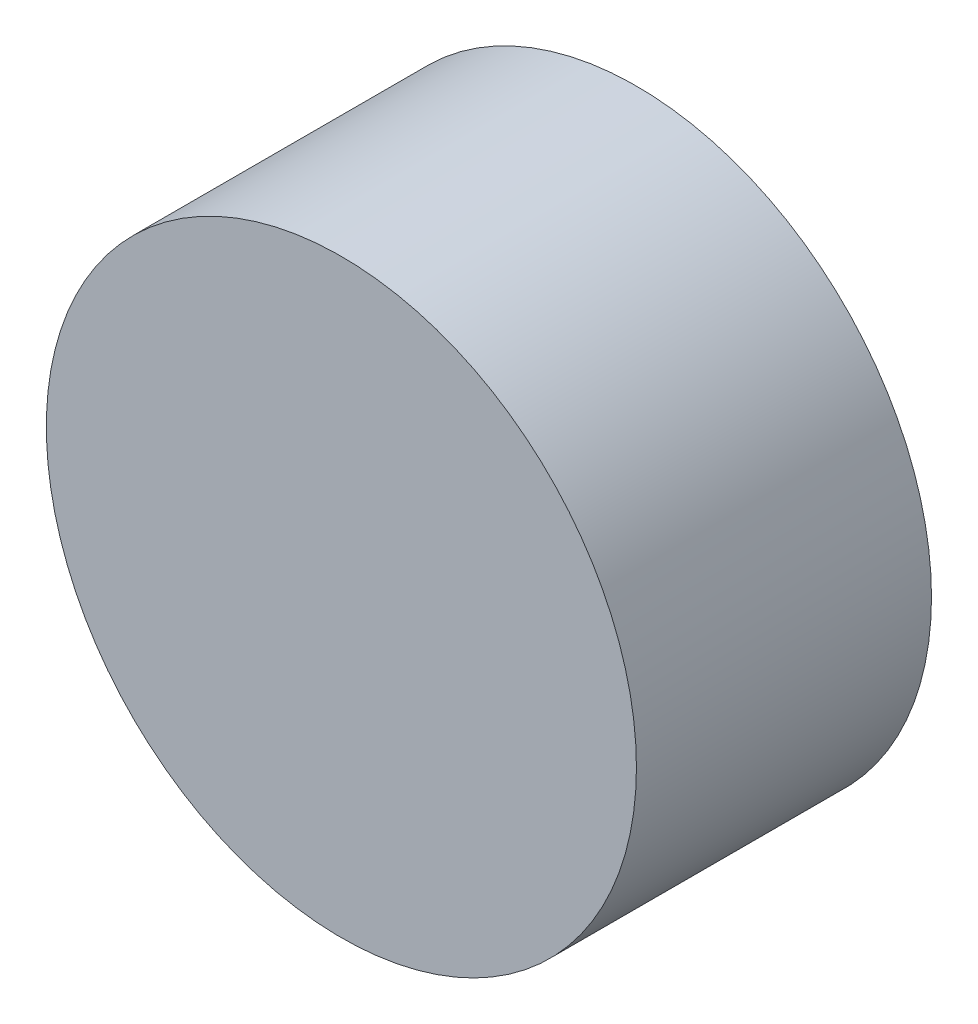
from build123d import *

# Parameters (mm, degrees)
ESQUISSE1_R          = 3
BASE_EXTRUSION_DEPTH = 3


with BuildPart() as part:
    # Esquisse1 → Base-Extrusion (new body)
    with BuildSketch(Plane.XY):
        Circle(ESQUISSE1_R)
    extrude(amount=BASE_EXTRUSION_DEPTH)


solid = part.part
